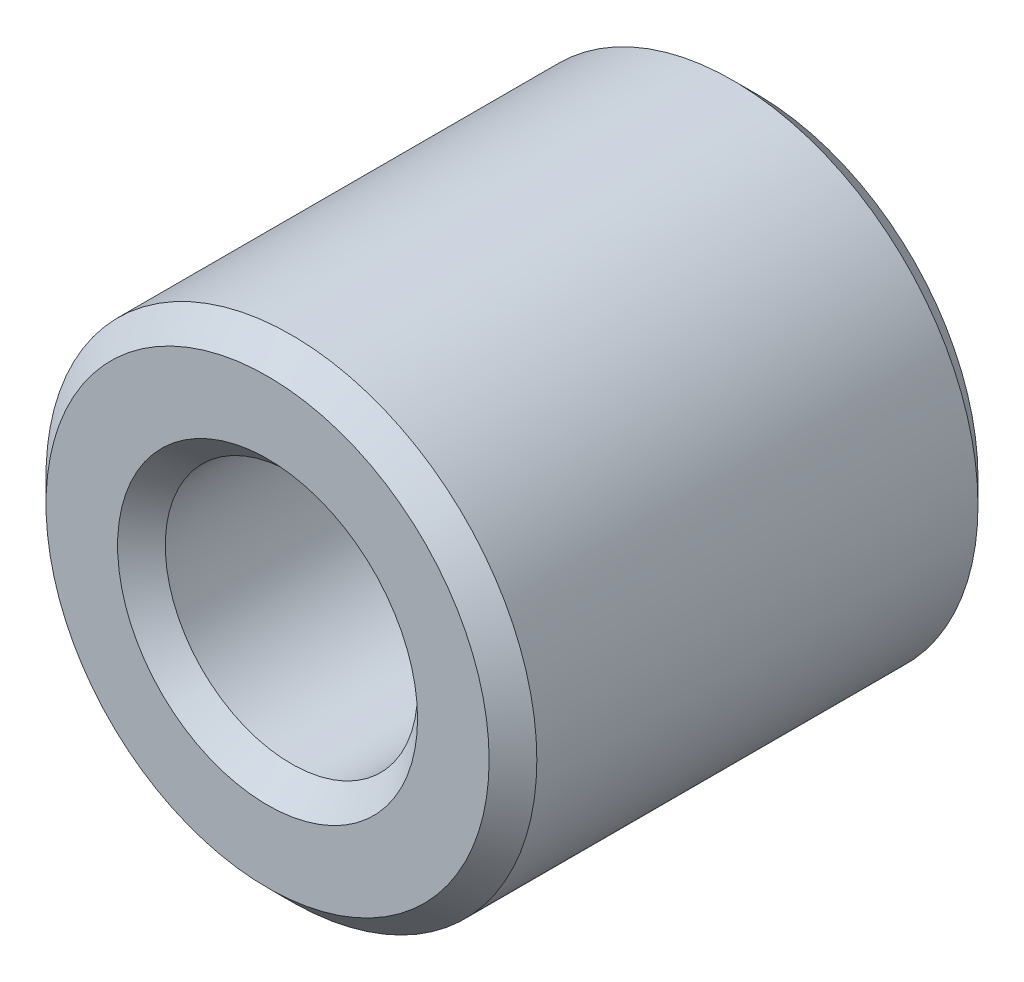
from build123d import *

# Parameters (mm, degrees)
SKETCH3_R           = 3.1877
SKETCH3_R_2         = 1.6383
BOSS_EXTRUDE1_DEPTH = 3.175
CHAMFER1_SIZE       = 0.30988


with BuildPart() as part:
    # Sketch3 → Boss-Extrude1 (new, symmetric)
    with BuildSketch(Plane.XY):
        Circle(SKETCH3_R)
        Circle(SKETCH3_R_2, mode=Mode.SUBTRACT)
    extrude(amount=BOSS_EXTRUDE1_DEPTH, both=True)

    # Chamfer1
    chamfer1_edges = [part.edges().sort_by_distance(p)[0] for p in [
        (-3.1877, 0, -3.175),
        (-3.1877, 0, 3.175),
        (-1.6383, 0, -3.175),
        (-1.6383, 0, 3.175),
    ]]
    chamfer(chamfer1_edges, length=CHAMFER1_SIZE)


solid = part.part
